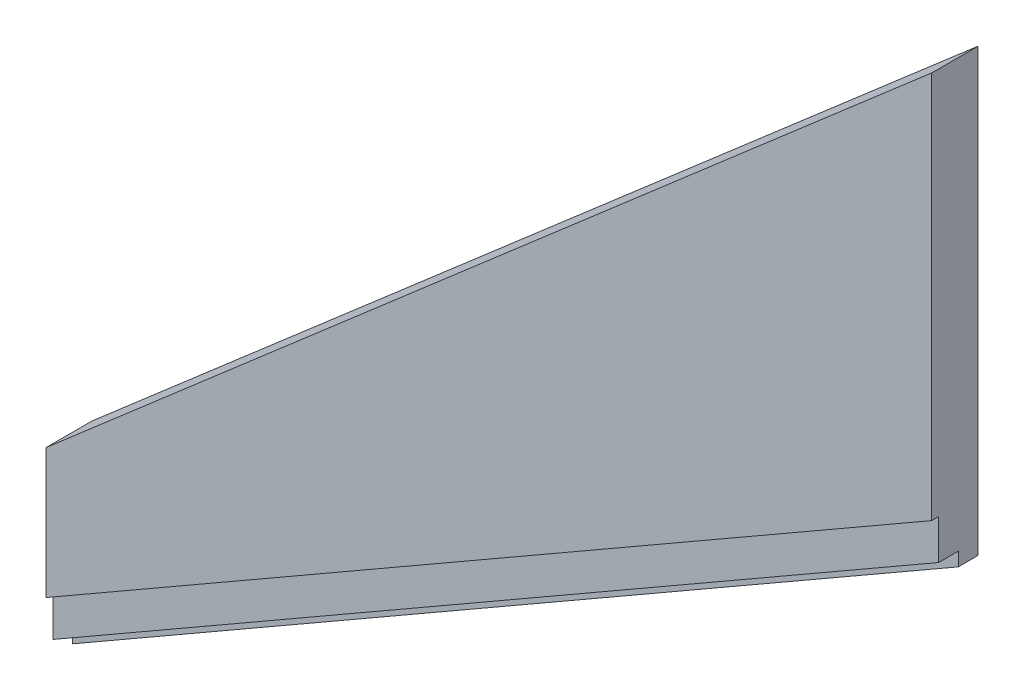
from build123d import *

# Parameters (mm, degrees)
EXTRUDE_1_DEPTH = 47
EXTRUDE_2_DEPTH = 40
EXTRUDE_3_DEPTH = 20


with BuildPart() as part:
    # Sketch 1 → Extrude 1 (new body)
    with BuildSketch(Plane.XY):
        Polygon((0, -226.783248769), (0, -620.780305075), (-900, -1138.487052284), (-900, -1006.487052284), align=None)
    extrude(amount=EXTRUDE_1_DEPTH)

    # Sketch 2 → Extrude 2 (add)
    with BuildSketch(Plane(origin=(0, 0, 0), x_dir=(-1, 0, 0), z_dir=(0, 0, -1))):
        Polygon((0, -620.780305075), (0, -661.157765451), (900, -1178.864512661), (900, -1138.487052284), align=None)
    extrude(amount=-EXTRUDE_2_DEPTH)

    # Sketch 3 → Extrude 3 (add)
    with BuildSketch(Plane(origin=(0, 0, 0), x_dir=(-1, 0, 0), z_dir=(0, 0, -1))):
        Polygon((0, -661.157765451), (0, -675.001466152), (900, -1192.708213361), (900, -1178.864512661), align=None)
    extrude(amount=-EXTRUDE_3_DEPTH)


solid = part.part
